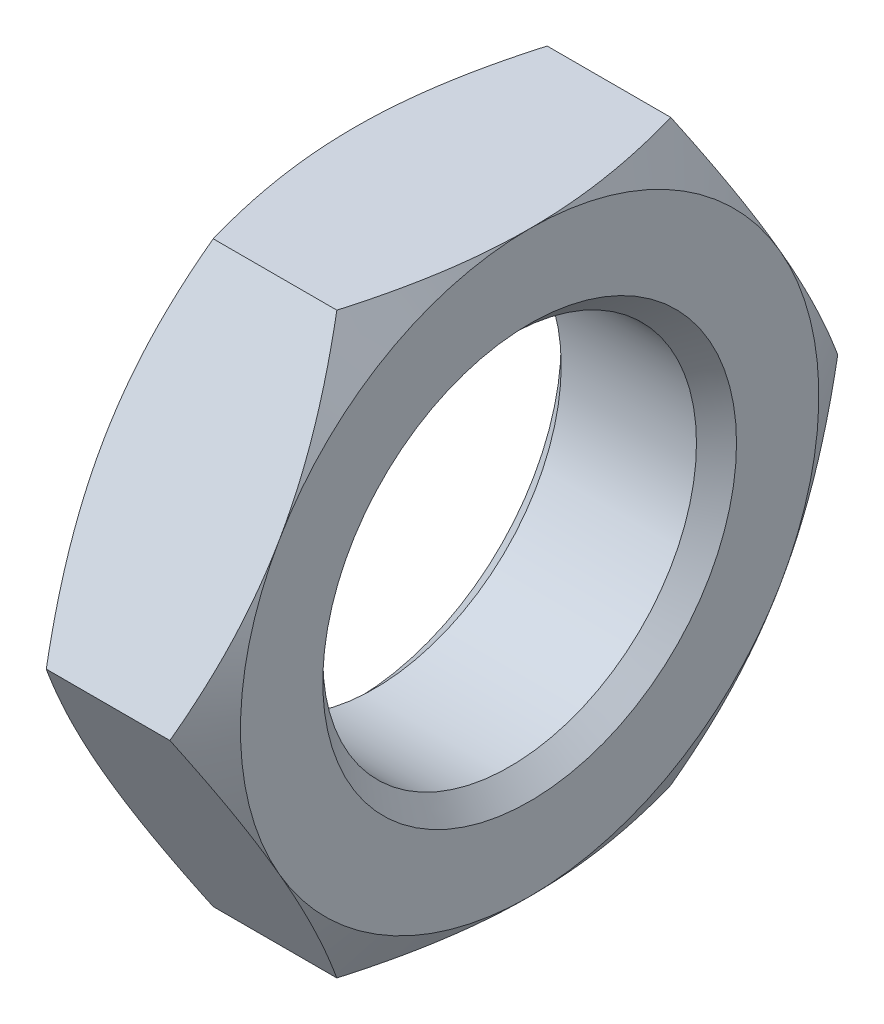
from build123d import *

# Parameters (mm, degrees)
SKETCH1_R      = 21
EXTRUDE1_DEPTH = 19.7
CHAMFER1_SIZE  = 2.25


with BuildPart() as part:
    # Sketch1 → Extrude1 (new body)
    with BuildSketch(Plane(origin=(0, 0, 0), x_dir=(0, 0, -1), z_dir=(1, 0, 0))):
        Polygon((18.763883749, 32.5), (-18.763883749, 32.5), (-37.527767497, 0), (-18.763883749, -32.5), (18.763883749, -32.5), (37.527767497, 0), align=None)
        Circle(SKETCH1_R, mode=Mode.SUBTRACT)
    extrude(amount=EXTRUDE1_DEPTH)

    # Sketch2 → Cut-Revolve1 (revolve, cut)
    with BuildSketch(Plane.XY):
        Polygon((19.7, 32.5), (19.7, 130), (0, 130), (0, 32.5), (9.85, 49.560700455), align=None)
    revolve(axis=Axis((19.7, 0, 0), (-1, 0, 0)), mode=Mode.SUBTRACT)

    # Chamfer1
    chamfer1_edges = [part.edges().sort_by_distance(p)[0] for p in [
        (0, 0, 21),
        (19.7, 0, 21),
    ]]
    chamfer(chamfer1_edges, length=CHAMFER1_SIZE)


solid = part.part
